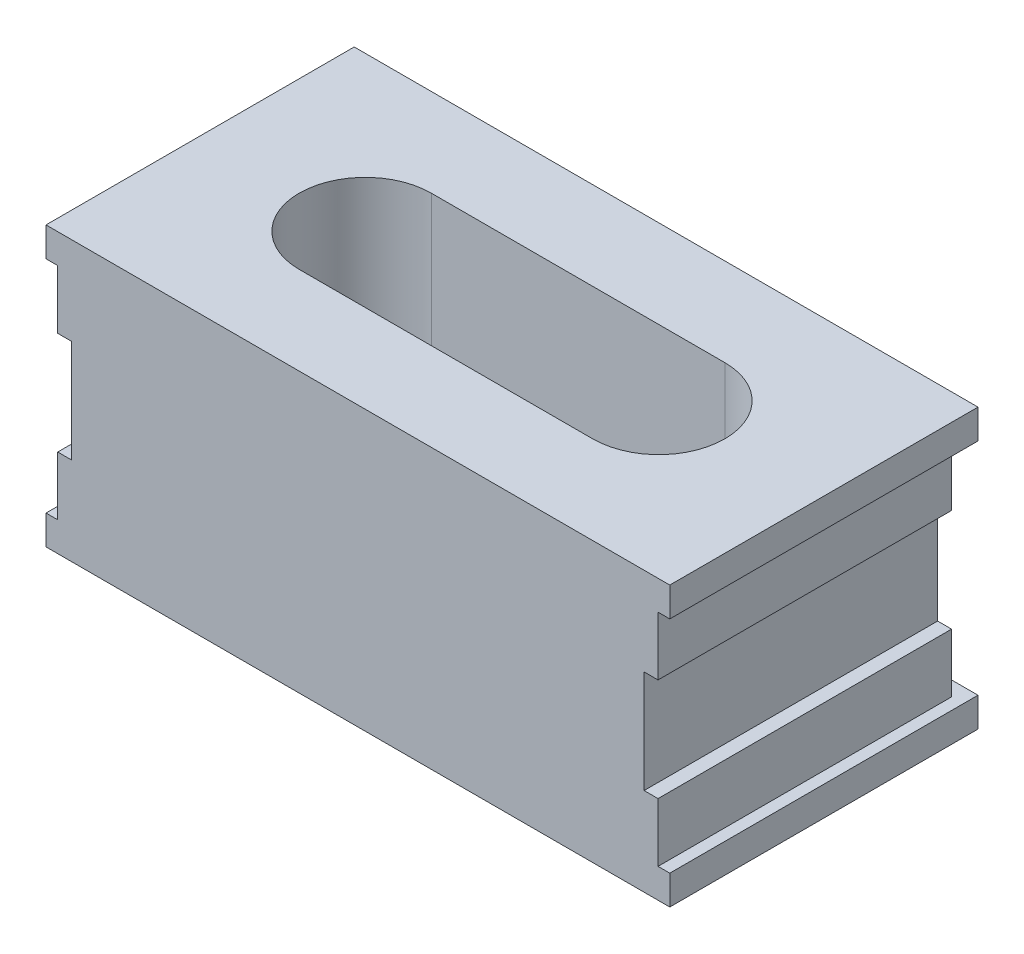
ISO-10303-21;
HEADER;
FILE_DESCRIPTION(('STEP AP214'),'2;1');
FILE_NAME('part.step','',(''),(''),'','','');
FILE_SCHEMA(('AUTOMOTIVE_DESIGN { 1 0 10303 214 1 1 1 1 }'));
ENDSEC;
DATA;
#1=APPLICATION_CONTEXT('core data for automotive mechanical design processes');
#2=APPLICATION_PROTOCOL_DEFINITION('international standard','automotive_design',2000,#1);
#3=PRODUCT_CONTEXT('',#1,'mechanical');
#4=PRODUCT('Part','Part','',(#3));
#5=PRODUCT_RELATED_PRODUCT_CATEGORY('part','',(#4));
#6=PRODUCT_DEFINITION_FORMATION('','',#4);
#7=PRODUCT_DEFINITION_CONTEXT('part definition',#1,'design');
#8=PRODUCT_DEFINITION('design','',#6,#7);
#9=PRODUCT_DEFINITION_SHAPE('','',#8);
#10=(LENGTH_UNIT() NAMED_UNIT(*) SI_UNIT(.MILLI.,.METRE.));
#11=(NAMED_UNIT(*) PLANE_ANGLE_UNIT() SI_UNIT($,.RADIAN.));
#12=(NAMED_UNIT(*) SI_UNIT($,.STERADIAN.) SOLID_ANGLE_UNIT());
#13=UNCERTAINTY_MEASURE_WITH_UNIT(LENGTH_MEASURE(1.E-05),#10,'distance_accuracy_value','');
#14=(GEOMETRIC_REPRESENTATION_CONTEXT(3) GLOBAL_UNCERTAINTY_ASSIGNED_CONTEXT((#13)) GLOBAL_UNIT_ASSIGNED_CONTEXT((#10,
#11,#12)) REPRESENTATION_CONTEXT('',''));
#15=CARTESIAN_POINT('',(0.,0.,0.));
#16=DIRECTION('',(0.,0.,1.));
#17=DIRECTION('',(1.,0.,0.));
#18=AXIS2_PLACEMENT_3D('',#15,#16,#17);
#19=CARTESIAN_POINT('',(-10.,-8.5,0.));
#20=DIRECTION('',(0.,-1.,0.));
#21=DIRECTION('',(0.,0.,-1.));
#22=AXIS2_PLACEMENT_3D('',#19,#20,#21);
#23=PLANE('',#22);
#24=CARTESIAN_POINT('',(-10.,-8.5,0.));
#25=DIRECTION('',(0.,-1.,0.));
#26=DIRECTION('',(0.,0.,-1.));
#27=AXIS2_PLACEMENT_3D('',#24,#25,#26);
#28=CIRCLE('',#27,4.5);
#29=CARTESIAN_POINT('',(-10.,-8.5,4.5));
#30=VERTEX_POINT('',#29);
#31=CARTESIAN_POINT('',(-10.,-8.5,-4.5));
#32=VERTEX_POINT('',#31);
#33=EDGE_CURVE('E238',#30,#32,#28,.T.);
#34=ORIENTED_EDGE('',*,*,#33,.F.);
#35=DIRECTION('',(-1.,0.,0.));
#36=VECTOR('',#35,1.);
#37=CARTESIAN_POINT('',(-10.,-8.5,4.5));
#38=LINE('',#37,#36);
#39=CARTESIAN_POINT('',(10.,-8.5,4.5));
#40=VERTEX_POINT('',#39);
#41=EDGE_CURVE('E213',#40,#30,#38,.T.);
#42=ORIENTED_EDGE('',*,*,#41,.F.);
#43=CARTESIAN_POINT('',(10.,-8.5,0.));
#44=DIRECTION('',(0.,-1.,0.));
#45=DIRECTION('',(0.,0.,-1.));
#46=AXIS2_PLACEMENT_3D('',#43,#44,#45);
#47=CIRCLE('',#46,4.5);
#48=CARTESIAN_POINT('',(10.,-8.5,-4.5));
#49=VERTEX_POINT('',#48);
#50=EDGE_CURVE('E19',#49,#40,#47,.T.);
#51=ORIENTED_EDGE('',*,*,#50,.F.);
#52=DIRECTION('',(1.,0.,0.));
#53=VECTOR('',#52,1.);
#54=CARTESIAN_POINT('',(10.,-8.5,-4.5));
#55=LINE('',#54,#53);
#56=EDGE_CURVE('E9',#32,#49,#55,.T.);
#57=ORIENTED_EDGE('',*,*,#56,.F.);
#58=EDGE_LOOP('',(#34,#42,#51,#57));
#59=FACE_BOUND('',#58,.T.);
#60=ADVANCED_FACE('F15',(#59),#23,.F.);
#61=CARTESIAN_POINT('',(10.,11.5,-4.5));
#62=DIRECTION('',(0.,0.,-1.));
#63=DIRECTION('',(0.,-1.,0.));
#64=AXIS2_PLACEMENT_3D('',#61,#62,#63);
#65=PLANE('',#64);
#66=DIRECTION('',(0.,-1.,0.));
#67=VECTOR('',#66,1.);
#68=CARTESIAN_POINT('',(-10.,11.5,-4.5));
#69=LINE('',#68,#67);
#70=CARTESIAN_POINT('',(-10.,9.5,-4.5));
#71=VERTEX_POINT('',#70);
#72=EDGE_CURVE('E240',#71,#32,#69,.T.);
#73=ORIENTED_EDGE('',*,*,#72,.T.);
#74=ORIENTED_EDGE('',*,*,#56,.T.);
#75=DIRECTION('',(0.,-1.,0.));
#76=VECTOR('',#75,1.);
#77=CARTESIAN_POINT('',(10.,11.5,-4.5));
#78=LINE('',#77,#76);
#79=CARTESIAN_POINT('',(10.,9.5,-4.5));
#80=VERTEX_POINT('',#79);
#81=EDGE_CURVE('E207',#80,#49,#78,.T.);
#82=ORIENTED_EDGE('',*,*,#81,.F.);
#83=DIRECTION('',(1.,0.,0.));
#84=VECTOR('',#83,1.);
#85=CARTESIAN_POINT('',(-21.25,9.5,-4.5));
#86=LINE('',#85,#84);
#87=EDGE_CURVE('E210',#71,#80,#86,.T.);
#88=ORIENTED_EDGE('',*,*,#87,.F.);
#89=EDGE_LOOP('',(#73,#74,#82,#88));
#90=FACE_BOUND('',#89,.T.);
#91=ADVANCED_FACE('F17',(#90),#65,.F.);
#92=CARTESIAN_POINT('',(10.,11.5,0.));
#93=DIRECTION('',(0.,-1.,0.));
#94=DIRECTION('',(0.,0.,-1.));
#95=AXIS2_PLACEMENT_3D('',#92,#93,#94);
#96=CYLINDRICAL_SURFACE('',#95,4.5);
#97=ORIENTED_EDGE('',*,*,#81,.T.);
#98=ORIENTED_EDGE('',*,*,#50,.T.);
#99=DIRECTION('',(0.,-1.,0.));
#100=VECTOR('',#99,1.);
#101=CARTESIAN_POINT('',(10.,11.5,4.5));
#102=LINE('',#101,#100);
#103=CARTESIAN_POINT('',(10.,9.5,4.5));
#104=VERTEX_POINT('',#103);
#105=EDGE_CURVE('E218',#104,#40,#102,.T.);
#106=ORIENTED_EDGE('',*,*,#105,.F.);
#107=CARTESIAN_POINT('',(10.,9.5,0.));
#108=DIRECTION('',(0.,-1.,0.));
#109=DIRECTION('',(0.,0.,-1.));
#110=AXIS2_PLACEMENT_3D('',#107,#108,#109);
#111=CIRCLE('',#110,4.5);
#112=EDGE_CURVE('E215',#80,#104,#111,.T.);
#113=ORIENTED_EDGE('',*,*,#112,.F.);
#114=EDGE_LOOP('',(#97,#98,#106,#113));
#115=FACE_BOUND('',#114,.T.);
#116=ADVANCED_FACE('F216',(#115),#96,.F.);
#117=CARTESIAN_POINT('',(-10.,11.5,4.5));
#118=DIRECTION('',(0.,0.,1.));
#119=DIRECTION('',(1.,0.,0.));
#120=AXIS2_PLACEMENT_3D('',#117,#118,#119);
#121=PLANE('',#120);
#122=ORIENTED_EDGE('',*,*,#105,.T.);
#123=ORIENTED_EDGE('',*,*,#41,.T.);
#124=DIRECTION('',(0.,-1.,0.));
#125=VECTOR('',#124,1.);
#126=CARTESIAN_POINT('',(-10.,11.5,4.5));
#127=LINE('',#126,#125);
#128=CARTESIAN_POINT('',(-10.,9.5,4.5));
#129=VERTEX_POINT('',#128);
#130=EDGE_CURVE('E223',#129,#30,#127,.T.);
#131=ORIENTED_EDGE('',*,*,#130,.F.);
#132=DIRECTION('',(-1.,0.,0.));
#133=VECTOR('',#132,1.);
#134=CARTESIAN_POINT('',(-21.25,9.5,4.5));
#135=LINE('',#134,#133);
#136=EDGE_CURVE('E234',#104,#129,#135,.T.);
#137=ORIENTED_EDGE('',*,*,#136,.F.);
#138=EDGE_LOOP('',(#122,#123,#131,#137));
#139=FACE_BOUND('',#138,.T.);
#140=ADVANCED_FACE('F574',(#139),#121,.F.);
#141=CARTESIAN_POINT('',(-10.,11.5,0.));
#142=DIRECTION('',(0.,-1.,0.));
#143=DIRECTION('',(0.,0.,-1.));
#144=AXIS2_PLACEMENT_3D('',#141,#142,#143);
#145=CYLINDRICAL_SURFACE('',#144,4.5);
#146=ORIENTED_EDGE('',*,*,#130,.T.);
#147=ORIENTED_EDGE('',*,*,#33,.T.);
#148=ORIENTED_EDGE('',*,*,#72,.F.);
#149=CARTESIAN_POINT('',(-10.,9.5,0.));
#150=DIRECTION('',(0.,-1.,0.));
#151=DIRECTION('',(0.,0.,-1.));
#152=AXIS2_PLACEMENT_3D('',#149,#150,#151);
#153=CIRCLE('',#152,4.5);
#154=EDGE_CURVE('E228',#129,#71,#153,.T.);
#155=ORIENTED_EDGE('',*,*,#154,.F.);
#156=EDGE_LOOP('',(#146,#147,#148,#155));
#157=FACE_BOUND('',#156,.T.);
#158=ADVANCED_FACE('F566',(#157),#145,.F.);
#159=CARTESIAN_POINT('',(-21.25,9.5,10.5));
#160=DIRECTION('',(0.,-1.,0.));
#161=DIRECTION('',(0.,0.,-1.));
#162=AXIS2_PLACEMENT_3D('',#159,#160,#161);
#163=PLANE('',#162);
#164=ORIENTED_EDGE('',*,*,#136,.T.);
#165=ORIENTED_EDGE('',*,*,#154,.T.);
#166=ORIENTED_EDGE('',*,*,#87,.T.);
#167=ORIENTED_EDGE('',*,*,#112,.T.);
#168=EDGE_LOOP('',(#164,#165,#166,#167));
#169=FACE_BOUND('',#168,.T.);
#170=DIRECTION('',(0.,0.,-1.));
#171=VECTOR('',#170,1.);
#172=CARTESIAN_POINT('',(21.25,9.5,10.5));
#173=LINE('',#172,#171);
#174=CARTESIAN_POINT('',(21.25,9.5,10.5));
#175=VERTEX_POINT('',#174);
#176=CARTESIAN_POINT('',(21.25,9.5,-10.5));
#177=VERTEX_POINT('',#176);
#178=EDGE_CURVE('E322',#175,#177,#173,.T.);
#179=ORIENTED_EDGE('',*,*,#178,.T.);
#180=DIRECTION('',(-1.,0.,0.));
#181=VECTOR('',#180,1.);
#182=CARTESIAN_POINT('',(-21.25,9.5,-10.5));
#183=LINE('',#182,#181);
#184=CARTESIAN_POINT('',(-21.25,9.5,-10.5));
#185=VERTEX_POINT('',#184);
#186=EDGE_CURVE('E288',#177,#185,#183,.T.);
#187=ORIENTED_EDGE('',*,*,#186,.T.);
#188=DIRECTION('',(0.,0.,-1.));
#189=VECTOR('',#188,1.);
#190=CARTESIAN_POINT('',(-21.25,9.5,10.5));
#191=LINE('',#190,#189);
#192=CARTESIAN_POINT('',(-21.25,9.5,10.5));
#193=VERTEX_POINT('',#192);
#194=EDGE_CURVE('E318',#193,#185,#191,.T.);
#195=ORIENTED_EDGE('',*,*,#194,.F.);
#196=DIRECTION('',(-1.,0.,0.));
#197=VECTOR('',#196,1.);
#198=CARTESIAN_POINT('',(-21.25,9.5,10.5));
#199=LINE('',#198,#197);
#200=EDGE_CURVE('E364',#175,#193,#199,.T.);
#201=ORIENTED_EDGE('',*,*,#200,.F.);
#202=EDGE_LOOP('',(#179,#187,#195,#201));
#203=FACE_BOUND('',#202,.T.);
#204=ADVANCED_FACE('F225',(#169,#203),#163,.F.);
#205=CARTESIAN_POINT('',(21.25,9.5,10.5));
#206=DIRECTION('',(-1.,0.,0.));
#207=DIRECTION('',(0.,1.,0.));
#208=AXIS2_PLACEMENT_3D('',#205,#206,#207);
#209=PLANE('',#208);
#210=DIRECTION('',(0.,1.,0.));
#211=VECTOR('',#210,1.);
#212=CARTESIAN_POINT('',(21.25,9.5,-10.5));
#213=LINE('',#212,#211);
#214=CARTESIAN_POINT('',(21.25,-9.5,-10.5));
#215=VERTEX_POINT('',#214);
#216=CARTESIAN_POINT('',(21.25,-7.5,-10.5));
#217=VERTEX_POINT('',#216);
#218=EDGE_CURVE('E320',#215,#217,#213,.T.);
#219=ORIENTED_EDGE('',*,*,#218,.T.);
#220=DIRECTION('',(0.,0.,1.));
#221=VECTOR('',#220,1.);
#222=CARTESIAN_POINT('',(21.25,-7.5,-11.5));
#223=LINE('',#222,#221);
#224=CARTESIAN_POINT('',(21.25,-7.5,10.5));
#225=VERTEX_POINT('',#224);
#226=EDGE_CURVE('E477',#217,#225,#223,.T.);
#227=ORIENTED_EDGE('',*,*,#226,.T.);
#228=DIRECTION('',(0.,1.,0.));
#229=VECTOR('',#228,1.);
#230=CARTESIAN_POINT('',(21.25,9.5,10.5));
#231=LINE('',#230,#229);
#232=CARTESIAN_POINT('',(21.25,-9.5,10.5));
#233=VERTEX_POINT('',#232);
#234=EDGE_CURVE('E355',#233,#225,#231,.T.);
#235=ORIENTED_EDGE('',*,*,#234,.F.);
#236=DIRECTION('',(0.,0.,-1.));
#237=VECTOR('',#236,1.);
#238=CARTESIAN_POINT('',(21.25,-9.5,10.5));
#239=LINE('',#238,#237);
#240=EDGE_CURVE('E281',#233,#215,#239,.T.);
#241=ORIENTED_EDGE('',*,*,#240,.T.);
#242=EDGE_LOOP('',(#219,#227,#235,#241));
#243=FACE_BOUND('',#242,.T.);
#244=ADVANCED_FACE('F498',(#243),#209,.F.);
#245=CARTESIAN_POINT('',(21.25,9.5,10.5));
#246=DIRECTION('',(-1.,0.,0.));
#247=DIRECTION('',(0.,1.,0.));
#248=AXIS2_PLACEMENT_3D('',#245,#246,#247);
#249=PLANE('',#248);
#250=DIRECTION('',(0.,1.,0.));
#251=VECTOR('',#250,1.);
#252=CARTESIAN_POINT('',(21.25,9.5,10.5));
#253=LINE('',#252,#251);
#254=CARTESIAN_POINT('',(21.25,7.5,10.5));
#255=VERTEX_POINT('',#254);
#256=EDGE_CURVE('E340',#255,#175,#253,.T.);
#257=ORIENTED_EDGE('',*,*,#256,.F.);
#258=DIRECTION('',(0.,0.,1.));
#259=VECTOR('',#258,1.);
#260=CARTESIAN_POINT('',(21.25,7.5,-11.5));
#261=LINE('',#260,#259);
#262=CARTESIAN_POINT('',(21.25,7.5,-10.5));
#263=VERTEX_POINT('',#262);
#264=EDGE_CURVE('E268',#263,#255,#261,.T.);
#265=ORIENTED_EDGE('',*,*,#264,.F.);
#266=DIRECTION('',(0.,1.,0.));
#267=VECTOR('',#266,1.);
#268=CARTESIAN_POINT('',(21.25,9.5,-10.5));
#269=LINE('',#268,#267);
#270=EDGE_CURVE('E292',#263,#177,#269,.T.);
#271=ORIENTED_EDGE('',*,*,#270,.T.);
#272=ORIENTED_EDGE('',*,*,#178,.F.);
#273=EDGE_LOOP('',(#257,#265,#271,#272));
#274=FACE_BOUND('',#273,.T.);
#275=ADVANCED_FACE('F541',(#274),#249,.F.);
#276=CARTESIAN_POINT('',(-21.25,-9.5,-10.5));
#277=DIRECTION('',(0.,0.,1.));
#278=DIRECTION('',(1.,0.,0.));
#279=AXIS2_PLACEMENT_3D('',#276,#277,#278);
#280=PLANE('',#279);
#281=DIRECTION('',(0.,-1.,0.));
#282=VECTOR('',#281,1.);
#283=CARTESIAN_POINT('',(-21.25,9.5,-10.5));
#284=LINE('',#283,#282);
#285=CARTESIAN_POINT('',(-21.25,-7.5,-10.5));
#286=VERTEX_POINT('',#285);
#287=CARTESIAN_POINT('',(-21.25,-9.5,-10.5));
#288=VERTEX_POINT('',#287);
#289=EDGE_CURVE('E317',#286,#288,#284,.T.);
#290=ORIENTED_EDGE('',*,*,#289,.F.);
#291=DIRECTION('',(1.,0.,0.));
#292=VECTOR('',#291,1.);
#293=CARTESIAN_POINT('',(-21.25,-7.5,-10.5));
#294=LINE('',#293,#292);
#295=EDGE_CURVE('E254',#286,#217,#294,.T.);
#296=ORIENTED_EDGE('',*,*,#295,.T.);
#297=ORIENTED_EDGE('',*,*,#218,.F.);
#298=DIRECTION('',(1.,0.,0.));
#299=VECTOR('',#298,1.);
#300=CARTESIAN_POINT('',(-21.25,-9.5,-10.5));
#301=LINE('',#300,#299);
#302=EDGE_CURVE('E277',#288,#215,#301,.T.);
#303=ORIENTED_EDGE('',*,*,#302,.F.);
#304=EDGE_LOOP('',(#290,#296,#297,#303));
#305=FACE_BOUND('',#304,.T.);
#306=ADVANCED_FACE('F487',(#305),#280,.F.);
#307=CARTESIAN_POINT('',(-21.25,9.5,10.5));
#308=DIRECTION('',(1.,0.,0.));
#309=DIRECTION('',(0.,1.,0.));
#310=AXIS2_PLACEMENT_3D('',#307,#308,#309);
#311=PLANE('',#310);
#312=DIRECTION('',(0.,0.,1.));
#313=VECTOR('',#312,1.);
#314=CARTESIAN_POINT('',(-21.25,7.5,-11.5));
#315=LINE('',#314,#313);
#316=CARTESIAN_POINT('',(-21.25,7.5,-10.5));
#317=VERTEX_POINT('',#316);
#318=CARTESIAN_POINT('',(-21.25,7.5,10.5));
#319=VERTEX_POINT('',#318);
#320=EDGE_CURVE('E261',#317,#319,#315,.T.);
#321=ORIENTED_EDGE('',*,*,#320,.T.);
#322=DIRECTION('',(0.,-1.,0.));
#323=VECTOR('',#322,1.);
#324=CARTESIAN_POINT('',(-21.25,9.5,10.5));
#325=LINE('',#324,#323);
#326=EDGE_CURVE('E380',#193,#319,#325,.T.);
#327=ORIENTED_EDGE('',*,*,#326,.F.);
#328=ORIENTED_EDGE('',*,*,#194,.T.);
#329=DIRECTION('',(0.,-1.,0.));
#330=VECTOR('',#329,1.);
#331=CARTESIAN_POINT('',(-21.25,9.5,-10.5));
#332=LINE('',#331,#330);
#333=EDGE_CURVE('E284',#185,#317,#332,.T.);
#334=ORIENTED_EDGE('',*,*,#333,.T.);
#335=EDGE_LOOP('',(#321,#327,#328,#334));
#336=FACE_BOUND('',#335,.T.);
#337=ADVANCED_FACE('F560',(#336),#311,.F.);
#338=CARTESIAN_POINT('',(-21.25,9.5,10.5));
#339=DIRECTION('',(1.,0.,0.));
#340=DIRECTION('',(0.,1.,0.));
#341=AXIS2_PLACEMENT_3D('',#338,#339,#340);
#342=PLANE('',#341);
#343=DIRECTION('',(0.,0.,1.));
#344=VECTOR('',#343,1.);
#345=CARTESIAN_POINT('',(-21.25,-7.5,-11.5));
#346=LINE('',#345,#344);
#347=CARTESIAN_POINT('',(-21.25,-7.5,10.5));
#348=VERTEX_POINT('',#347);
#349=EDGE_CURVE('E256',#286,#348,#346,.T.);
#350=ORIENTED_EDGE('',*,*,#349,.F.);
#351=ORIENTED_EDGE('',*,*,#289,.T.);
#352=DIRECTION('',(0.,0.,-1.));
#353=VECTOR('',#352,1.);
#354=CARTESIAN_POINT('',(-21.25,-9.5,10.5));
#355=LINE('',#354,#353);
#356=CARTESIAN_POINT('',(-21.25,-9.5,10.5));
#357=VERTEX_POINT('',#356);
#358=EDGE_CURVE('E273',#357,#288,#355,.T.);
#359=ORIENTED_EDGE('',*,*,#358,.F.);
#360=DIRECTION('',(0.,-1.,0.));
#361=VECTOR('',#360,1.);
#362=CARTESIAN_POINT('',(-21.25,9.5,10.5));
#363=LINE('',#362,#361);
#364=EDGE_CURVE('E356',#348,#357,#363,.T.);
#365=ORIENTED_EDGE('',*,*,#364,.F.);
#366=EDGE_LOOP('',(#350,#351,#359,#365));
#367=FACE_BOUND('',#366,.T.);
#368=ADVANCED_FACE('F504',(#367),#342,.F.);
#369=CARTESIAN_POINT('',(-20.45,-5.5,-11.5));
#370=DIRECTION('',(-1.,0.,0.));
#371=DIRECTION('',(0.,0.,1.));
#372=AXIS2_PLACEMENT_3D('',#369,#370,#371);
#373=PLANE('',#372);
#374=DIRECTION('',(0.,0.,1.));
#375=VECTOR('',#374,1.);
#376=CARTESIAN_POINT('',(-20.45,-3.5,-11.5));
#377=LINE('',#376,#375);
#378=CARTESIAN_POINT('',(-20.45,-3.5,-9.5));
#379=VERTEX_POINT('',#378);
#380=CARTESIAN_POINT('',(-20.45,-3.5,10.5));
#381=VERTEX_POINT('',#380);
#382=EDGE_CURVE('E314',#379,#381,#377,.T.);
#383=ORIENTED_EDGE('',*,*,#382,.F.);
#384=DIRECTION('',(0.,-1.,0.));
#385=VECTOR('',#384,1.);
#386=CARTESIAN_POINT('',(-20.45,-5.5,-9.5));
#387=LINE('',#386,#385);
#388=CARTESIAN_POINT('',(-20.45,-7.5,-9.5));
#389=VERTEX_POINT('',#388);
#390=EDGE_CURVE('E468',#379,#389,#387,.T.);
#391=ORIENTED_EDGE('',*,*,#390,.T.);
#392=DIRECTION('',(0.,0.,-1.));
#393=VECTOR('',#392,1.);
#394=CARTESIAN_POINT('',(-20.45,-7.5,10.5));
#395=LINE('',#394,#393);
#396=CARTESIAN_POINT('',(-20.45,-7.5,10.5));
#397=VERTEX_POINT('',#396);
#398=EDGE_CURVE('E472',#397,#389,#395,.T.);
#399=ORIENTED_EDGE('',*,*,#398,.F.);
#400=DIRECTION('',(0.,-1.,0.));
#401=VECTOR('',#400,1.);
#402=CARTESIAN_POINT('',(-20.45,-5.5,10.5));
#403=LINE('',#402,#401);
#404=EDGE_CURVE('E360',#381,#397,#403,.T.);
#405=ORIENTED_EDGE('',*,*,#404,.F.);
#406=EDGE_LOOP('',(#383,#391,#399,#405));
#407=FACE_BOUND('',#406,.T.);
#408=ADVANCED_FACE('F619',(#407),#373,.T.);
#409=CARTESIAN_POINT('',(-20.45,-3.5,-11.5));
#410=DIRECTION('',(0.,1.,0.));
#411=DIRECTION('',(1.,0.,0.));
#412=AXIS2_PLACEMENT_3D('',#409,#410,#411);
#413=PLANE('',#412);
#414=DIRECTION('',(-1.,0.,0.));
#415=VECTOR('',#414,1.);
#416=CARTESIAN_POINT('',(-20.45,-3.5,10.5));
#417=LINE('',#416,#415);
#418=CARTESIAN_POINT('',(-19.5,-3.5,10.5));
#419=VERTEX_POINT('',#418);
#420=EDGE_CURVE('E335',#419,#381,#417,.T.);
#421=ORIENTED_EDGE('',*,*,#420,.F.);
#422=DIRECTION('',(0.,0.,-1.));
#423=VECTOR('',#422,1.);
#424=CARTESIAN_POINT('',(-19.5,-3.5,10.5));
#425=LINE('',#424,#423);
#426=CARTESIAN_POINT('',(-19.5,-3.5,-9.5));
#427=VERTEX_POINT('',#426);
#428=EDGE_CURVE('E313',#419,#427,#425,.T.);
#429=ORIENTED_EDGE('',*,*,#428,.T.);
#430=DIRECTION('',(-1.,0.,0.));
#431=VECTOR('',#430,1.);
#432=CARTESIAN_POINT('',(-20.45,-3.5,-9.5));
#433=LINE('',#432,#431);
#434=EDGE_CURVE('E420',#427,#379,#433,.T.);
#435=ORIENTED_EDGE('',*,*,#434,.T.);
#436=ORIENTED_EDGE('',*,*,#382,.T.);
#437=EDGE_LOOP('',(#421,#429,#435,#436));
#438=FACE_BOUND('',#437,.T.);
#439=ADVANCED_FACE('F618',(#438),#413,.T.);
#440=CARTESIAN_POINT('',(-19.5,1.75,-11.5));
#441=DIRECTION('',(-1.,0.,0.));
#442=DIRECTION('',(0.,0.,1.));
#443=AXIS2_PLACEMENT_3D('',#440,#441,#442);
#444=PLANE('',#443);
#445=DIRECTION('',(0.,-1.,0.));
#446=VECTOR('',#445,1.);
#447=CARTESIAN_POINT('',(-19.5,1.75,10.5));
#448=LINE('',#447,#446);
#449=CARTESIAN_POINT('',(-19.5,3.5,10.5));
#450=VERTEX_POINT('',#449);
#451=EDGE_CURVE('E332',#450,#419,#448,.T.);
#452=ORIENTED_EDGE('',*,*,#451,.F.);
#453=DIRECTION('',(0.,0.,-1.));
#454=VECTOR('',#453,1.);
#455=CARTESIAN_POINT('',(-19.5,3.5,10.5));
#456=LINE('',#455,#454);
#457=CARTESIAN_POINT('',(-19.5,3.5,-9.5));
#458=VERTEX_POINT('',#457);
#459=EDGE_CURVE('E310',#450,#458,#456,.T.);
#460=ORIENTED_EDGE('',*,*,#459,.T.);
#461=DIRECTION('',(0.,-1.,0.));
#462=VECTOR('',#461,1.);
#463=CARTESIAN_POINT('',(-19.5,1.75,-9.5));
#464=LINE('',#463,#462);
#465=EDGE_CURVE('E424',#458,#427,#464,.T.);
#466=ORIENTED_EDGE('',*,*,#465,.T.);
#467=ORIENTED_EDGE('',*,*,#428,.F.);
#468=EDGE_LOOP('',(#452,#460,#466,#467));
#469=FACE_BOUND('',#468,.T.);
#470=ADVANCED_FACE('F608',(#469),#444,.T.);
#471=CARTESIAN_POINT('',(-20.45,3.5,-11.5));
#472=DIRECTION('',(0.,-1.,0.));
#473=DIRECTION('',(0.,0.,-1.));
#474=AXIS2_PLACEMENT_3D('',#471,#472,#473);
#475=PLANE('',#474);
#476=DIRECTION('',(0.,0.,1.));
#477=VECTOR('',#476,1.);
#478=CARTESIAN_POINT('',(-20.45,3.5,-11.5));
#479=LINE('',#478,#477);
#480=CARTESIAN_POINT('',(-20.45,3.5,-9.5));
#481=VERTEX_POINT('',#480);
#482=CARTESIAN_POINT('',(-20.45,3.5,10.5));
#483=VERTEX_POINT('',#482);
#484=EDGE_CURVE('E306',#481,#483,#479,.T.);
#485=ORIENTED_EDGE('',*,*,#484,.F.);
#486=DIRECTION('',(1.,0.,0.));
#487=VECTOR('',#486,1.);
#488=CARTESIAN_POINT('',(-20.45,3.5,-9.5));
#489=LINE('',#488,#487);
#490=EDGE_CURVE('E428',#481,#458,#489,.T.);
#491=ORIENTED_EDGE('',*,*,#490,.T.);
#492=ORIENTED_EDGE('',*,*,#459,.F.);
#493=DIRECTION('',(1.,0.,0.));
#494=VECTOR('',#493,1.);
#495=CARTESIAN_POINT('',(-20.45,3.5,10.5));
#496=LINE('',#495,#494);
#497=EDGE_CURVE('E416',#483,#450,#496,.T.);
#498=ORIENTED_EDGE('',*,*,#497,.F.);
#499=EDGE_LOOP('',(#485,#491,#492,#498));
#500=FACE_BOUND('',#499,.T.);
#501=ADVANCED_FACE('F599',(#500),#475,.T.);
#502=CARTESIAN_POINT('',(-20.45,5.5,-11.5));
#503=DIRECTION('',(-1.,0.,0.));
#504=DIRECTION('',(0.,0.,1.));
#505=AXIS2_PLACEMENT_3D('',#502,#503,#504);
#506=PLANE('',#505);
#507=DIRECTION('',(0.,-1.,0.));
#508=VECTOR('',#507,1.);
#509=CARTESIAN_POINT('',(-20.45,5.5,10.5));
#510=LINE('',#509,#508);
#511=CARTESIAN_POINT('',(-20.45,7.5,10.5));
#512=VERTEX_POINT('',#511);
#513=EDGE_CURVE('E410',#512,#483,#510,.T.);
#514=ORIENTED_EDGE('',*,*,#513,.F.);
#515=DIRECTION('',(0.,0.,1.));
#516=VECTOR('',#515,1.);
#517=CARTESIAN_POINT('',(-20.45,7.5,10.5));
#518=LINE('',#517,#516);
#519=CARTESIAN_POINT('',(-20.45,7.5,-9.5));
#520=VERTEX_POINT('',#519);
#521=EDGE_CURVE('E258',#520,#512,#518,.T.);
#522=ORIENTED_EDGE('',*,*,#521,.F.);
#523=DIRECTION('',(0.,-1.,0.));
#524=VECTOR('',#523,1.);
#525=CARTESIAN_POINT('',(-20.45,5.5,-9.5));
#526=LINE('',#525,#524);
#527=EDGE_CURVE('E432',#520,#481,#526,.T.);
#528=ORIENTED_EDGE('',*,*,#527,.T.);
#529=ORIENTED_EDGE('',*,*,#484,.T.);
#530=EDGE_LOOP('',(#514,#522,#528,#529));
#531=FACE_BOUND('',#530,.T.);
#532=ADVANCED_FACE('F557',(#531),#506,.T.);
#533=CARTESIAN_POINT('',(20.45,5.5,-11.5));
#534=DIRECTION('',(-1.,0.,0.));
#535=DIRECTION('',(0.,0.,1.));
#536=AXIS2_PLACEMENT_3D('',#533,#534,#535);
#537=PLANE('',#536);
#538=DIRECTION('',(0.,-1.,0.));
#539=VECTOR('',#538,1.);
#540=CARTESIAN_POINT('',(20.45,5.5,-9.5));
#541=LINE('',#540,#539);
#542=CARTESIAN_POINT('',(20.45,7.5,-9.5));
#543=VERTEX_POINT('',#542);
#544=CARTESIAN_POINT('',(20.45,3.5,-9.5));
#545=VERTEX_POINT('',#544);
#546=EDGE_CURVE('E440',#543,#545,#541,.T.);
#547=ORIENTED_EDGE('',*,*,#546,.F.);
#548=DIRECTION('',(0.,0.,1.));
#549=VECTOR('',#548,1.);
#550=CARTESIAN_POINT('',(20.45,7.5,10.5));
#551=LINE('',#550,#549);
#552=CARTESIAN_POINT('',(20.45,7.5,10.5));
#553=VERTEX_POINT('',#552);
#554=EDGE_CURVE('E272',#543,#553,#551,.T.);
#555=ORIENTED_EDGE('',*,*,#554,.T.);
#556=DIRECTION('',(0.,-1.,0.));
#557=VECTOR('',#556,1.);
#558=CARTESIAN_POINT('',(20.45,5.5,10.5));
#559=LINE('',#558,#557);
#560=CARTESIAN_POINT('',(20.45,3.5,10.5));
#561=VERTEX_POINT('',#560);
#562=EDGE_CURVE('E341',#553,#561,#559,.T.);
#563=ORIENTED_EDGE('',*,*,#562,.T.);
#564=DIRECTION('',(0.,0.,1.));
#565=VECTOR('',#564,1.);
#566=CARTESIAN_POINT('',(20.45,3.5,-11.5));
#567=LINE('',#566,#565);
#568=EDGE_CURVE('E304',#545,#561,#567,.T.);
#569=ORIENTED_EDGE('',*,*,#568,.F.);
#570=EDGE_LOOP('',(#547,#555,#563,#569));
#571=FACE_BOUND('',#570,.T.);
#572=ADVANCED_FACE('F544',(#571),#537,.F.);
#573=CARTESIAN_POINT('',(20.45,3.5,-11.5));
#574=DIRECTION('',(0.,1.,0.));
#575=DIRECTION('',(1.,0.,0.));
#576=AXIS2_PLACEMENT_3D('',#573,#574,#575);
#577=PLANE('',#576);
#578=DIRECTION('',(-1.,0.,0.));
#579=VECTOR('',#578,1.);
#580=CARTESIAN_POINT('',(20.45,3.5,-9.5));
#581=LINE('',#580,#579);
#582=CARTESIAN_POINT('',(19.5,3.5,-9.5));
#583=VERTEX_POINT('',#582);
#584=EDGE_CURVE('E444',#545,#583,#581,.T.);
#585=ORIENTED_EDGE('',*,*,#584,.F.);
#586=ORIENTED_EDGE('',*,*,#568,.T.);
#587=DIRECTION('',(-1.,0.,0.));
#588=VECTOR('',#587,1.);
#589=CARTESIAN_POINT('',(20.45,3.5,10.5));
#590=LINE('',#589,#588);
#591=CARTESIAN_POINT('',(19.5,3.5,10.5));
#592=VERTEX_POINT('',#591);
#593=EDGE_CURVE('E368',#561,#592,#590,.T.);
#594=ORIENTED_EDGE('',*,*,#593,.T.);
#595=DIRECTION('',(0.,0.,-1.));
#596=VECTOR('',#595,1.);
#597=CARTESIAN_POINT('',(19.5,3.5,10.5));
#598=LINE('',#597,#596);
#599=EDGE_CURVE('E301',#592,#583,#598,.T.);
#600=ORIENTED_EDGE('',*,*,#599,.T.);
#601=EDGE_LOOP('',(#585,#586,#594,#600));
#602=FACE_BOUND('',#601,.T.);
#603=ADVANCED_FACE('F547',(#602),#577,.F.);
#604=CARTESIAN_POINT('',(19.5,1.75,-11.5));
#605=DIRECTION('',(-1.,0.,0.));
#606=DIRECTION('',(0.,0.,1.));
#607=AXIS2_PLACEMENT_3D('',#604,#605,#606);
#608=PLANE('',#607);
#609=DIRECTION('',(0.,-1.,0.));
#610=VECTOR('',#609,1.);
#611=CARTESIAN_POINT('',(19.5,1.75,-9.5));
#612=LINE('',#611,#610);
#613=CARTESIAN_POINT('',(19.5,-3.5,-9.5));
#614=VERTEX_POINT('',#613);
#615=EDGE_CURVE('E448',#583,#614,#612,.T.);
#616=ORIENTED_EDGE('',*,*,#615,.F.);
#617=ORIENTED_EDGE('',*,*,#599,.F.);
#618=DIRECTION('',(0.,-1.,0.));
#619=VECTOR('',#618,1.);
#620=CARTESIAN_POINT('',(19.5,1.75,10.5));
#621=LINE('',#620,#619);
#622=CARTESIAN_POINT('',(19.5,-3.5,10.5));
#623=VERTEX_POINT('',#622);
#624=EDGE_CURVE('E349',#592,#623,#621,.T.);
#625=ORIENTED_EDGE('',*,*,#624,.T.);
#626=DIRECTION('',(0.,0.,-1.));
#627=VECTOR('',#626,1.);
#628=CARTESIAN_POINT('',(19.5,-3.5,10.5));
#629=LINE('',#628,#627);
#630=EDGE_CURVE('E300',#623,#614,#629,.T.);
#631=ORIENTED_EDGE('',*,*,#630,.T.);
#632=EDGE_LOOP('',(#616,#617,#625,#631));
#633=FACE_BOUND('',#632,.T.);
#634=ADVANCED_FACE('F604',(#633),#608,.F.);
#635=CARTESIAN_POINT('',(20.45,-3.5,-11.5));
#636=DIRECTION('',(0.,-1.,0.));
#637=DIRECTION('',(0.,0.,-1.));
#638=AXIS2_PLACEMENT_3D('',#635,#636,#637);
#639=PLANE('',#638);
#640=DIRECTION('',(1.,0.,0.));
#641=VECTOR('',#640,1.);
#642=CARTESIAN_POINT('',(20.45,-3.5,-9.5));
#643=LINE('',#642,#641);
#644=CARTESIAN_POINT('',(20.45,-3.5,-9.5));
#645=VERTEX_POINT('',#644);
#646=EDGE_CURVE('E454',#614,#645,#643,.T.);
#647=ORIENTED_EDGE('',*,*,#646,.F.);
#648=ORIENTED_EDGE('',*,*,#630,.F.);
#649=DIRECTION('',(1.,0.,0.));
#650=VECTOR('',#649,1.);
#651=CARTESIAN_POINT('',(20.45,-3.5,10.5));
#652=LINE('',#651,#650);
#653=CARTESIAN_POINT('',(20.45,-3.5,10.5));
#654=VERTEX_POINT('',#653);
#655=EDGE_CURVE('E345',#623,#654,#652,.T.);
#656=ORIENTED_EDGE('',*,*,#655,.T.);
#657=DIRECTION('',(0.,0.,1.));
#658=VECTOR('',#657,1.);
#659=CARTESIAN_POINT('',(20.45,-3.5,-11.5));
#660=LINE('',#659,#658);
#661=EDGE_CURVE('E296',#645,#654,#660,.T.);
#662=ORIENTED_EDGE('',*,*,#661,.F.);
#663=EDGE_LOOP('',(#647,#648,#656,#662));
#664=FACE_BOUND('',#663,.T.);
#665=ADVANCED_FACE('F601',(#664),#639,.F.);
#666=CARTESIAN_POINT('',(20.45,-5.5,-11.5));
#667=DIRECTION('',(-1.,0.,0.));
#668=DIRECTION('',(0.,0.,1.));
#669=AXIS2_PLACEMENT_3D('',#666,#667,#668);
#670=PLANE('',#669);
#671=DIRECTION('',(0.,-1.,0.));
#672=VECTOR('',#671,1.);
#673=CARTESIAN_POINT('',(20.45,-5.5,-9.5));
#674=LINE('',#673,#672);
#675=CARTESIAN_POINT('',(20.45,-7.5,-9.5));
#676=VERTEX_POINT('',#675);
#677=EDGE_CURVE('E460',#645,#676,#674,.T.);
#678=ORIENTED_EDGE('',*,*,#677,.F.);
#679=ORIENTED_EDGE('',*,*,#661,.T.);
#680=DIRECTION('',(0.,-1.,0.));
#681=VECTOR('',#680,1.);
#682=CARTESIAN_POINT('',(20.45,-5.5,10.5));
#683=LINE('',#682,#681);
#684=CARTESIAN_POINT('',(20.45,-7.5,10.5));
#685=VERTEX_POINT('',#684);
#686=EDGE_CURVE('E350',#654,#685,#683,.T.);
#687=ORIENTED_EDGE('',*,*,#686,.T.);
#688=DIRECTION('',(0.,0.,-1.));
#689=VECTOR('',#688,1.);
#690=CARTESIAN_POINT('',(20.45,-7.5,10.5));
#691=LINE('',#690,#689);
#692=EDGE_CURVE('E475',#685,#676,#691,.T.);
#693=ORIENTED_EDGE('',*,*,#692,.T.);
#694=EDGE_LOOP('',(#678,#679,#687,#693));
#695=FACE_BOUND('',#694,.T.);
#696=ADVANCED_FACE('F585',(#695),#670,.F.);
#697=CARTESIAN_POINT('',(-21.25,-9.5,-10.5));
#698=DIRECTION('',(0.,0.,1.));
#699=DIRECTION('',(1.,0.,0.));
#700=AXIS2_PLACEMENT_3D('',#697,#698,#699);
#701=PLANE('',#700);
#702=DIRECTION('',(-1.,0.,0.));
#703=VECTOR('',#702,1.);
#704=CARTESIAN_POINT('',(-21.25,7.5,-10.5));
#705=LINE('',#704,#703);
#706=EDGE_CURVE('E264',#263,#317,#705,.T.);
#707=ORIENTED_EDGE('',*,*,#706,.T.);
#708=ORIENTED_EDGE('',*,*,#333,.F.);
#709=ORIENTED_EDGE('',*,*,#186,.F.);
#710=ORIENTED_EDGE('',*,*,#270,.F.);
#711=EDGE_LOOP('',(#707,#708,#709,#710));
#712=FACE_BOUND('',#711,.T.);
#713=ADVANCED_FACE('F564',(#712),#701,.F.);
#714=CARTESIAN_POINT('',(-21.25,-9.5,10.5));
#715=DIRECTION('',(0.,1.,0.));
#716=DIRECTION('',(1.,0.,0.));
#717=AXIS2_PLACEMENT_3D('',#714,#715,#716);
#718=PLANE('',#717);
#719=ORIENTED_EDGE('',*,*,#358,.T.);
#720=ORIENTED_EDGE('',*,*,#302,.T.);
#721=ORIENTED_EDGE('',*,*,#240,.F.);
#722=DIRECTION('',(1.,0.,0.));
#723=VECTOR('',#722,1.);
#724=CARTESIAN_POINT('',(-21.25,-9.5,10.5));
#725=LINE('',#724,#723);
#726=EDGE_CURVE('E351',#357,#233,#725,.T.);
#727=ORIENTED_EDGE('',*,*,#726,.F.);
#728=EDGE_LOOP('',(#719,#720,#721,#727));
#729=FACE_BOUND('',#728,.T.);
#730=ADVANCED_FACE('F500',(#729),#718,.F.);
#731=CARTESIAN_POINT('',(21.25,7.5,-11.5));
#732=DIRECTION('',(0.,1.,0.));
#733=DIRECTION('',(1.,0.,0.));
#734=AXIS2_PLACEMENT_3D('',#731,#732,#733);
#735=PLANE('',#734);
#736=DIRECTION('',(1.,0.,0.));
#737=VECTOR('',#736,1.);
#738=CARTESIAN_POINT('',(21.25,7.5,-9.5));
#739=LINE('',#738,#737);
#740=EDGE_CURVE('E435',#520,#543,#739,.T.);
#741=ORIENTED_EDGE('',*,*,#740,.F.);
#742=ORIENTED_EDGE('',*,*,#521,.T.);
#743=DIRECTION('',(1.,0.,0.));
#744=VECTOR('',#743,1.);
#745=CARTESIAN_POINT('',(-21.25,7.5,10.5));
#746=LINE('',#745,#744);
#747=EDGE_CURVE('E406',#319,#512,#746,.T.);
#748=ORIENTED_EDGE('',*,*,#747,.F.);
#749=ORIENTED_EDGE('',*,*,#320,.F.);
#750=ORIENTED_EDGE('',*,*,#706,.F.);
#751=ORIENTED_EDGE('',*,*,#264,.T.);
#752=DIRECTION('',(-1.,0.,0.));
#753=VECTOR('',#752,1.);
#754=CARTESIAN_POINT('',(21.25,7.5,10.5));
#755=LINE('',#754,#753);
#756=EDGE_CURVE('E336',#255,#553,#755,.T.);
#757=ORIENTED_EDGE('',*,*,#756,.T.);
#758=ORIENTED_EDGE('',*,*,#554,.F.);
#759=EDGE_LOOP('',(#741,#742,#748,#749,#750,#751,#757,#758));
#760=FACE_BOUND('',#759,.T.);
#761=ADVANCED_FACE('F536',(#760),#735,.F.);
#762=CARTESIAN_POINT('',(21.25,-7.5,-11.5));
#763=DIRECTION('',(0.,-1.,0.));
#764=DIRECTION('',(0.,0.,-1.));
#765=AXIS2_PLACEMENT_3D('',#762,#763,#764);
#766=PLANE('',#765);
#767=ORIENTED_EDGE('',*,*,#398,.T.);
#768=DIRECTION('',(-1.,0.,0.));
#769=VECTOR('',#768,1.);
#770=CARTESIAN_POINT('',(21.25,-7.5,-9.5));
#771=LINE('',#770,#769);
#772=EDGE_CURVE('E464',#676,#389,#771,.T.);
#773=ORIENTED_EDGE('',*,*,#772,.F.);
#774=ORIENTED_EDGE('',*,*,#692,.F.);
#775=DIRECTION('',(1.,0.,0.));
#776=VECTOR('',#775,1.);
#777=CARTESIAN_POINT('',(21.25,-7.5,10.5));
#778=LINE('',#777,#776);
#779=EDGE_CURVE('E372',#685,#225,#778,.T.);
#780=ORIENTED_EDGE('',*,*,#779,.T.);
#781=ORIENTED_EDGE('',*,*,#226,.F.);
#782=ORIENTED_EDGE('',*,*,#295,.F.);
#783=ORIENTED_EDGE('',*,*,#349,.T.);
#784=DIRECTION('',(-1.,0.,0.));
#785=VECTOR('',#784,1.);
#786=CARTESIAN_POINT('',(-21.25,-7.5,10.5));
#787=LINE('',#786,#785);
#788=EDGE_CURVE('E376',#397,#348,#787,.T.);
#789=ORIENTED_EDGE('',*,*,#788,.F.);
#790=EDGE_LOOP('',(#767,#773,#774,#780,#781,#782,#783,#789));
#791=FACE_BOUND('',#790,.T.);
#792=ADVANCED_FACE('F491',(#791),#766,.F.);
#793=CARTESIAN_POINT('',(21.25,-7.5,-9.5));
#794=DIRECTION('',(0.,0.,-1.));
#795=DIRECTION('',(0.,-1.,0.));
#796=AXIS2_PLACEMENT_3D('',#793,#794,#795);
#797=PLANE('',#796);
#798=ORIENTED_EDGE('',*,*,#434,.F.);
#799=ORIENTED_EDGE('',*,*,#465,.F.);
#800=ORIENTED_EDGE('',*,*,#490,.F.);
#801=ORIENTED_EDGE('',*,*,#527,.F.);
#802=ORIENTED_EDGE('',*,*,#740,.T.);
#803=ORIENTED_EDGE('',*,*,#546,.T.);
#804=ORIENTED_EDGE('',*,*,#584,.T.);
#805=ORIENTED_EDGE('',*,*,#615,.T.);
#806=ORIENTED_EDGE('',*,*,#646,.T.);
#807=ORIENTED_EDGE('',*,*,#677,.T.);
#808=ORIENTED_EDGE('',*,*,#772,.T.);
#809=ORIENTED_EDGE('',*,*,#390,.F.);
#810=EDGE_LOOP('',(#798,#799,#800,#801,#802,#803,#804,#805,#806,#807,#808,#809));
#811=FACE_BOUND('',#810,.T.);
#812=ADVANCED_FACE('F551',(#811),#797,.T.);
#813=CARTESIAN_POINT('',(-21.25,-9.5,10.5));
#814=DIRECTION('',(0.,0.,1.));
#815=DIRECTION('',(1.,0.,0.));
#816=AXIS2_PLACEMENT_3D('',#813,#814,#815);
#817=PLANE('',#816);
#818=ORIENTED_EDGE('',*,*,#451,.T.);
#819=ORIENTED_EDGE('',*,*,#420,.T.);
#820=ORIENTED_EDGE('',*,*,#404,.T.);
#821=ORIENTED_EDGE('',*,*,#788,.T.);
#822=ORIENTED_EDGE('',*,*,#364,.T.);
#823=ORIENTED_EDGE('',*,*,#726,.T.);
#824=ORIENTED_EDGE('',*,*,#234,.T.);
#825=ORIENTED_EDGE('',*,*,#779,.F.);
#826=ORIENTED_EDGE('',*,*,#686,.F.);
#827=ORIENTED_EDGE('',*,*,#655,.F.);
#828=ORIENTED_EDGE('',*,*,#624,.F.);
#829=ORIENTED_EDGE('',*,*,#593,.F.);
#830=ORIENTED_EDGE('',*,*,#562,.F.);
#831=ORIENTED_EDGE('',*,*,#756,.F.);
#832=ORIENTED_EDGE('',*,*,#256,.T.);
#833=ORIENTED_EDGE('',*,*,#200,.T.);
#834=ORIENTED_EDGE('',*,*,#326,.T.);
#835=ORIENTED_EDGE('',*,*,#747,.T.);
#836=ORIENTED_EDGE('',*,*,#513,.T.);
#837=ORIENTED_EDGE('',*,*,#497,.T.);
#838=EDGE_LOOP('',(#818,#819,#820,#821,#822,#823,#824,#825,#826,#827,#828,#829,#830,#831,#832,
#833,#834,#835,#836,#837));
#839=FACE_BOUND('',#838,.T.);
#840=ADVANCED_FACE('F496',(#839),#817,.T.);
#841=CLOSED_SHELL('',(#60,#91,#116,#140,#158,#204,#244,#275,#306,#337,#368,#408,#439,#470,#501,
#532,#572,#603,#634,#665,#696,#713,#730,#761,#792,#812,#840));
#842=MANIFOLD_SOLID_BREP('B1',#841);
#843=ADVANCED_BREP_SHAPE_REPRESENTATION('',(#18,#842),#14);
#844=SHAPE_DEFINITION_REPRESENTATION(#9,#843);
ENDSEC;
END-ISO-10303-21;
